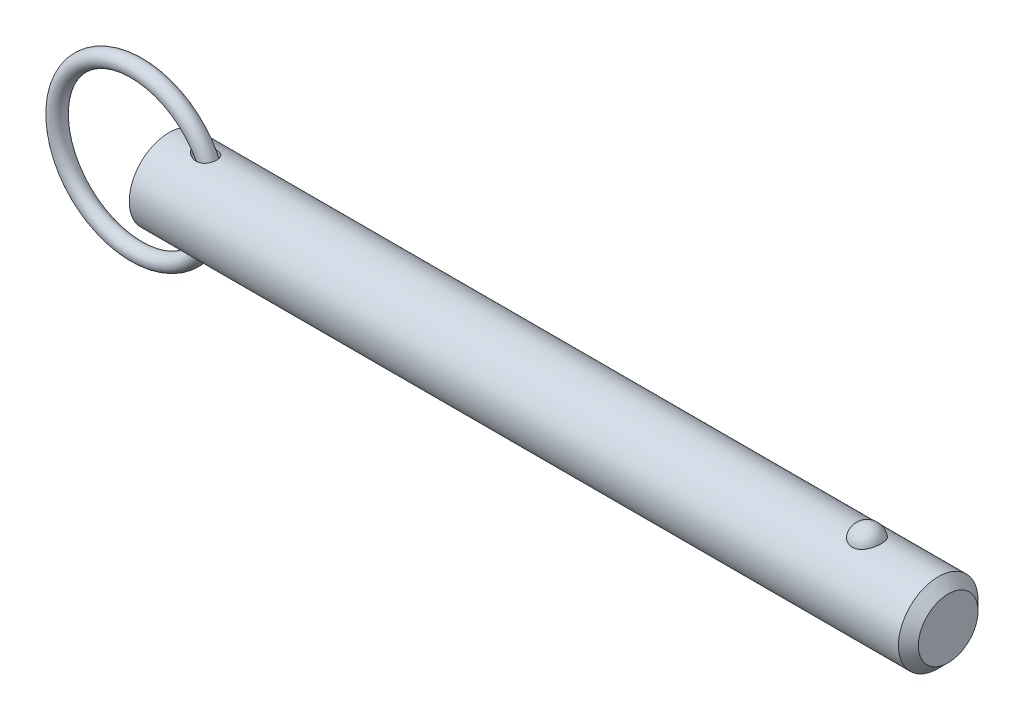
ISO-10303-21;
HEADER;
FILE_DESCRIPTION(('STEP AP214'),'2;1');
FILE_NAME('part.step','',(''),(''),'','','');
FILE_SCHEMA(('AUTOMOTIVE_DESIGN { 1 0 10303 214 1 1 1 1 }'));
ENDSEC;
DATA;
#1=APPLICATION_CONTEXT('core data for automotive mechanical design processes');
#2=APPLICATION_PROTOCOL_DEFINITION('international standard','automotive_design',2000,#1);
#3=PRODUCT_CONTEXT('',#1,'mechanical');
#4=PRODUCT('Part','Part','',(#3));
#5=PRODUCT_RELATED_PRODUCT_CATEGORY('part','',(#4));
#6=PRODUCT_DEFINITION_FORMATION('','',#4);
#7=PRODUCT_DEFINITION_CONTEXT('part definition',#1,'design');
#8=PRODUCT_DEFINITION('design','',#6,#7);
#9=PRODUCT_DEFINITION_SHAPE('','',#8);
#10=(LENGTH_UNIT() NAMED_UNIT(*) SI_UNIT(.MILLI.,.METRE.));
#11=(NAMED_UNIT(*) PLANE_ANGLE_UNIT() SI_UNIT($,.RADIAN.));
#12=(NAMED_UNIT(*) SI_UNIT($,.STERADIAN.) SOLID_ANGLE_UNIT());
#13=UNCERTAINTY_MEASURE_WITH_UNIT(LENGTH_MEASURE(1.E-05),#10,'distance_accuracy_value','');
#14=(GEOMETRIC_REPRESENTATION_CONTEXT(3) GLOBAL_UNCERTAINTY_ASSIGNED_CONTEXT((#13)) GLOBAL_UNIT_ASSIGNED_CONTEXT((#10,
#11,#12)) REPRESENTATION_CONTEXT('',''));
#15=CARTESIAN_POINT('',(0.,0.,0.));
#16=DIRECTION('',(0.,0.,1.));
#17=DIRECTION('',(1.,0.,0.));
#18=AXIS2_PLACEMENT_3D('',#15,#16,#17);
#19=CARTESIAN_POINT('',(-6.46799987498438,0.,0.));
#20=DIRECTION('',(0.,0.,1.));
#21=DIRECTION('',(1.,0.,0.));
#22=AXIS2_PLACEMENT_3D('',#19,#20,#21);
#23=TOROIDAL_SURFACE('',#22,15.875,1.588);
#24=CARTESIAN_POINT('',(10.9950001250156,0.,0.));
#25=VERTEX_POINT('',#24);
#26=VERTEX_LOOP('',#25);
#27=FACE_BOUND('',#26,.T.);
#28=ADVANCED_FACE('P0_F12',(#27),#23,.T.);
#29=CLOSED_SHELL('',(#28));
#30=MANIFOLD_SOLID_BREP('P0_B1',#29);
#31=CARTESIAN_POINT('',(0.,0.,0.));
#32=DIRECTION('',(1.,0.,0.));
#33=DIRECTION('',(0.,0.,-1.));
#34=AXIS2_PLACEMENT_3D('',#31,#32,#33);
#35=CYLINDRICAL_SURFACE('',#34,7.94);
#36=CARTESIAN_POINT('',(5.37881269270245,7.8641200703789,-1.0950869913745));
#37=CARTESIAN_POINT('',(5.49078530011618,7.84653010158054,-1.22142628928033));
#38=CARTESIAN_POINT('',(5.61742164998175,7.82766483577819,-1.33478448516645));
#39=CARTESIAN_POINT('',(5.82155225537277,7.80005811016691,-1.48501770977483));
#40=CARTESIAN_POINT('',(5.89211597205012,7.79095331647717,-1.53186949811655));
#41=CARTESIAN_POINT('',(6.03726296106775,7.77331484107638,-1.61899652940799));
#42=CARTESIAN_POINT('',(6.11184478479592,7.76478095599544,-1.65927412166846));
#43=CARTESIAN_POINT('',(6.31831542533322,7.74290334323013,-1.75933205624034));
#44=CARTESIAN_POINT('',(6.45343253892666,7.73042593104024,-1.81276183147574));
#45=CARTESIAN_POINT('',(6.73017339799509,7.70966096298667,-1.89912673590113));
#46=CARTESIAN_POINT('',(6.87179099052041,7.70136953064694,-1.93208083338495));
#47=CARTESIAN_POINT('',(7.17522096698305,7.6896684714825,-1.97820987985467));
#48=CARTESIAN_POINT('',(7.33750100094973,7.68691980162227,-1.98871513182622));
#49=CARTESIAN_POINT('',(7.57994245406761,7.68880305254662,-1.98137951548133));
#50=CARTESIAN_POINT('',(7.66059155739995,7.69043175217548,-1.97508575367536));
#51=CARTESIAN_POINT('',(7.82077465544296,7.69570110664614,-1.95445819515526));
#52=CARTESIAN_POINT('',(7.9003091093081,7.69934090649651,-1.94012781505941));
#53=CARTESIAN_POINT('',(8.09280087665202,7.71066069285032,-1.89475688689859));
#54=CARTESIAN_POINT('',(8.20465204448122,7.71942251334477,-1.85909462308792));
#55=CARTESIAN_POINT('',(8.42059371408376,7.74035594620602,-1.7699066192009));
#56=CARTESIAN_POINT('',(8.52468939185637,7.75252525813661,-1.7163929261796));
#57=CARTESIAN_POINT('',(8.72211003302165,7.77903750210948,-1.59192358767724));
#58=CARTESIAN_POINT('',(8.81539818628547,7.79338749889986,-1.52091076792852));
#59=CARTESIAN_POINT('',(8.98759177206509,7.8225086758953,-1.36321590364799));
#60=CARTESIAN_POINT('',(9.06649712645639,7.83727985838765,-1.27653377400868));
#61=CARTESIAN_POINT('',(9.20311499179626,7.86453692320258,-1.09567667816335));
#62=CARTESIAN_POINT('',(9.26180839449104,7.8771064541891,-1.00225329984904));
#63=CARTESIAN_POINT('',(9.36257622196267,7.89954213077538,-0.8065472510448));
#64=CARTESIAN_POINT('',(9.40465301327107,7.9094086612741,-0.704265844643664));
#65=CARTESIAN_POINT('',(9.47062404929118,7.92520709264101,-0.495461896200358));
#66=CARTESIAN_POINT('',(9.49478817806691,7.9311972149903,-0.389028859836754));
#67=CARTESIAN_POINT('',(9.52544004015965,7.93883641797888,-0.173494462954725));
#68=CARTESIAN_POINT('',(9.5319278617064,7.94048552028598,-0.0643931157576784));
#69=CARTESIAN_POINT('',(9.52707996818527,7.93926454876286,0.153487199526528));
#70=CARTESIAN_POINT('',(9.51572796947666,7.93639034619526,0.26226578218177));
#71=CARTESIAN_POINT('',(9.47542322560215,7.92642470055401,0.476313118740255));
#72=CARTESIAN_POINT('',(9.44647056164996,7.91933327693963,0.581581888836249));
#73=CARTESIAN_POINT('',(9.3716401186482,7.90170355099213,0.785602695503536));
#74=CARTESIAN_POINT('',(9.32576415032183,7.89116561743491,0.884355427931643));
#75=CARTESIAN_POINT('',(9.21823065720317,7.8677977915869,1.07254831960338));
#76=CARTESIAN_POINT('',(9.15657431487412,7.85496807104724,1.16198917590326));
#77=CARTESIAN_POINT('',(9.01919194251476,7.82843688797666,1.32903649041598));
#78=CARTESIAN_POINT('',(8.94347744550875,7.81473614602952,1.40665255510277));
#79=CARTESIAN_POINT('',(8.78012086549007,7.7879321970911,1.5481977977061));
#80=CARTESIAN_POINT('',(8.69247914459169,7.77482897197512,1.61212739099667));
#81=CARTESIAN_POINT('',(8.50642314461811,7.75037063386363,1.72592270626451));
#82=CARTESIAN_POINT('',(8.40786430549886,7.73904540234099,1.77555777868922));
#83=CARTESIAN_POINT('',(8.2039870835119,7.71943979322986,1.85894844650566));
#84=CARTESIAN_POINT('',(8.0986670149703,7.7111601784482,1.89270006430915));
#85=CARTESIAN_POINT('',(7.87703213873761,7.69782475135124,1.94625652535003));
#86=CARTESIAN_POINT('',(7.76044899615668,7.69301557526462,1.96500324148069));
#87=CARTESIAN_POINT('',(7.52574256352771,7.68770484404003,1.98567257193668));
#88=CARTESIAN_POINT('',(7.40761868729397,7.68720497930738,1.98758858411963));
#89=CARTESIAN_POINT('',(7.15639592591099,7.69044495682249,1.97502233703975));
#90=CARTESIAN_POINT('',(7.02341871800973,7.69476380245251,1.9583009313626));
#91=CARTESIAN_POINT('',(6.7612589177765,7.70776394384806,1.90648094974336));
#92=CARTESIAN_POINT('',(6.6320804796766,7.71644984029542,1.87136299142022));
#93=CARTESIAN_POINT('',(6.35978215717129,7.73875442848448,1.77707737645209));
#94=CARTESIAN_POINT('',(6.2177212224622,7.75293863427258,1.71496895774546));
#95=CARTESIAN_POINT('',(5.94559201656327,7.78383102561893,1.56880760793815));
#96=CARTESIAN_POINT('',(5.81552062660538,7.80053855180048,1.48476040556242));
#97=CARTESIAN_POINT('',(5.60081087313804,7.83035955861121,1.31701356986));
#98=CARTESIAN_POINT('',(5.51265224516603,7.84340226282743,1.23780647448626));
#99=CARTESIAN_POINT('',(5.34976240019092,7.86852524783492,1.06647953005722));
#100=CARTESIAN_POINT('',(5.27500719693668,7.88060722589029,0.974383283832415));
#101=CARTESIAN_POINT('',(5.15877594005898,7.89990441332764,0.800548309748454));
#102=CARTESIAN_POINT('',(5.11360209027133,7.90759876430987,0.721348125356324));
#103=CARTESIAN_POINT('',(5.03655060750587,7.92090267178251,0.556518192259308));
#104=CARTESIAN_POINT('',(5.00466157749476,7.92651401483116,0.470894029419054));
#105=CARTESIAN_POINT('',(4.95653766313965,7.93503671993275,0.294356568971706));
#106=CARTESIAN_POINT('',(4.94043621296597,7.93792505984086,0.203404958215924));
#107=CARTESIAN_POINT('',(4.92605720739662,7.94050250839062,0.0200631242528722));
#108=CARTESIAN_POINT('',(4.92776929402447,7.9401934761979,-0.072326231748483));
#109=CARTESIAN_POINT('',(4.94742735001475,7.93667454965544,-0.24325091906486));
#110=CARTESIAN_POINT('',(4.96327131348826,7.93384031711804,-0.32204819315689));
#111=CARTESIAN_POINT('',(5.00707570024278,7.92609115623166,-0.47605810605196));
#112=CARTESIAN_POINT('',(5.0350396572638,7.92117562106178,-0.551269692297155));
#113=CARTESIAN_POINT('',(5.10737112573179,7.90866290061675,-0.70999547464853));
#114=CARTESIAN_POINT('',(5.15379379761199,7.90074105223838,-0.792541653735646));
#115=CARTESIAN_POINT('',(5.2582083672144,7.88338732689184,-0.949781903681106));
#116=CARTESIAN_POINT('',(5.31621941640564,7.87395295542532,-1.02446265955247));
#117=CARTESIAN_POINT('',(5.37881269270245,7.8641200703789,-1.0950869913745));
#118=B_SPLINE_CURVE_WITH_KNOTS('',3,(#36,#37,#38,#39,#40,#41,#42,#43,#44,#45,#46,#47,#48,#49,
#50,#51,#52,#53,#54,#55,#56,#57,#58,#59,#60,#61,#62,#63,#64,#65,#66,#67,#68,#69,#70,#71,#72,#73,
#74,#75,#76,#77,#78,#79,#80,#81,#82,#83,#84,#85,#86,#87,#88,#89,#90,#91,#92,#93,#94,#95,#96,#97,
#98,#99,#100,#101,#102,#103,#104,#105,#106,#107,#108,#109,#110,#111,#112,#113,#114,#115,#116,
#117),.UNSPECIFIED.,.T.,.F.,(4,2,2,2,2,2,2,2,2,2,2,2,2,2,2,2,2,2,2,2,2,2,2,2,2,2,2,2,2,2,2,2,2,
2,2,2,2,2,2,2,4),(0.,0.508599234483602,0.763935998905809,1.01918131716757,1.45492798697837,
1.89027038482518,2.37502798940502,2.61739702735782,2.8596631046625,3.21120678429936,
3.56251370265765,3.91498401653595,4.26745624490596,4.59897839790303,4.93045331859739,
5.2568264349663,5.58319792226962,5.909867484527,6.23653553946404,6.56316865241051,
6.88977729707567,7.21611917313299,7.54245114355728,7.87378632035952,8.20520442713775,
8.55832700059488,8.91158808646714,9.31234018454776,9.71351536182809,10.1786231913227,
10.6436096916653,11.0001264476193,11.3559986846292,11.6294791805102,11.9027245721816,
12.1782599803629,12.4536351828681,12.693828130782,12.9340911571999,13.2179277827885,
13.5022374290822),.UNSPECIFIED.);
#119=CARTESIAN_POINT('',(5.37881269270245,7.8641200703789,-1.0950869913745));
#120=VERTEX_POINT('',#119);
#121=EDGE_CURVE('P1_E40',#120,#120,#118,.T.);
#122=ORIENTED_EDGE('',*,*,#121,.T.);
#123=EDGE_LOOP('',(#122));
#124=FACE_BOUND('',#123,.T.);
#125=CARTESIAN_POINT('',(153.595,0.,0.));
#126=DIRECTION('',(1.,0.,0.));
#127=DIRECTION('',(0.,0.,-1.));
#128=AXIS2_PLACEMENT_3D('',#125,#126,#127);
#129=CIRCLE('',#128,7.94);
#130=CARTESIAN_POINT('',(153.595,0.,-7.94));
#131=VERTEX_POINT('',#130);
#132=EDGE_CURVE('P1_E25',#131,#131,#129,.T.);
#133=ORIENTED_EDGE('',*,*,#132,.F.);
#134=EDGE_LOOP('',(#133));
#135=FACE_BOUND('',#134,.T.);
#136=CARTESIAN_POINT('',(0.,0.,0.));
#137=DIRECTION('',(1.,0.,0.));
#138=DIRECTION('',(0.,0.,-1.));
#139=AXIS2_PLACEMENT_3D('',#136,#137,#138);
#140=CIRCLE('',#139,7.94);
#141=CARTESIAN_POINT('',(0.,0.,-7.94));
#142=VERTEX_POINT('',#141);
#143=EDGE_CURVE('P1_E9',#142,#142,#140,.T.);
#144=ORIENTED_EDGE('',*,*,#143,.T.);
#145=EDGE_LOOP('',(#144));
#146=FACE_BOUND('',#145,.T.);
#147=CARTESIAN_POINT('',(139.364907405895,7.37767842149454,2.93486986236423));
#148=CARTESIAN_POINT('',(139.212749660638,7.3776732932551,2.93487505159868));
#149=CARTESIAN_POINT('',(139.060632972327,7.38258419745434,2.92262454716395));
#150=CARTESIAN_POINT('',(138.760928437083,7.40163229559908,2.87404196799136));
#151=CARTESIAN_POINT('',(138.613339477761,7.41576720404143,2.83771585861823));
#152=CARTESIAN_POINT('',(138.327018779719,7.45161576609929,2.74218769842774));
#153=CARTESIAN_POINT('',(138.188274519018,7.47331841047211,2.68301886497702));
#154=CARTESIAN_POINT('',(137.922882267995,7.52194082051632,2.54350967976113));
#155=CARTESIAN_POINT('',(137.796236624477,7.54886159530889,2.46316523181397));
#156=CARTESIAN_POINT('',(137.554534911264,7.60594671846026,2.28090375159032));
#157=CARTESIAN_POINT('',(137.439906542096,7.63618114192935,2.1784421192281));
#158=CARTESIAN_POINT('',(137.228878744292,7.69614046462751,1.95608495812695));
#159=CARTESIAN_POINT('',(137.132482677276,7.72586526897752,1.83618622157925));
#160=CARTESIAN_POINT('',(136.955938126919,7.78314821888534,1.57628086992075));
#161=CARTESIAN_POINT('',(136.876707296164,7.81055035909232,1.43561546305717));
#162=CARTESIAN_POINT('',(136.741797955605,7.85879631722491,1.142363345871));
#163=CARTESIAN_POINT('',(136.686121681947,7.87963951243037,0.989775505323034));
#164=CARTESIAN_POINT('',(136.59881215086,7.91289645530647,0.674619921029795));
#165=CARTESIAN_POINT('',(136.56753090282,7.92518652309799,0.511941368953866));
#166=CARTESIAN_POINT('',(136.530975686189,7.93958930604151,0.183247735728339));
#167=CARTESIAN_POINT('',(136.525701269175,7.94170219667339,0.0172327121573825));
#168=CARTESIAN_POINT('',(136.541231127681,7.93554931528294,-0.31267286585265));
#169=CARTESIAN_POINT('',(136.561925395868,7.92732732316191,-0.476569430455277));
#170=CARTESIAN_POINT('',(136.62878655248,7.90141534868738,-0.79830524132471));
#171=CARTESIAN_POINT('',(136.674953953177,7.88372517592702,-0.956144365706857));
#172=CARTESIAN_POINT('',(136.791898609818,7.84066230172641,-1.26152073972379));
#173=CARTESIAN_POINT('',(136.862704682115,7.81528060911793,-1.40904568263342));
#174=CARTESIAN_POINT('',(137.027478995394,7.75948672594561,-1.68950598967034));
#175=CARTESIAN_POINT('',(137.121448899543,7.72907417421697,-1.82244030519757));
#176=CARTESIAN_POINT('',(137.330839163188,7.66640424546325,-2.07032792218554));
#177=CARTESIAN_POINT('',(137.446315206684,7.63414223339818,-2.18523308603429));
#178=CARTESIAN_POINT('',(137.6959006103,7.57149681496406,-2.39329737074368));
#179=CARTESIAN_POINT('',(137.830008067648,7.54111321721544,-2.48645870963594));
#180=CARTESIAN_POINT('',(138.110111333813,7.48650742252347,-2.64628132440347));
#181=CARTESIAN_POINT('',(138.255760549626,7.46215900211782,-2.71350554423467));
#182=CARTESIAN_POINT('',(138.557425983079,7.42171253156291,-2.82226614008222));
#183=CARTESIAN_POINT('',(138.713438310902,7.40561140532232,-2.86381209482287));
#184=CARTESIAN_POINT('',(139.022970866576,7.3842679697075,-2.9183907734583));
#185=CARTESIAN_POINT('',(139.176222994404,7.37852109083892,-2.93275024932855));
#186=CARTESIAN_POINT('',(139.483070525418,7.37700973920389,-2.93655208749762));
#187=CARTESIAN_POINT('',(139.636665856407,7.38124333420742,-2.92599927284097));
#188=CARTESIAN_POINT('',(139.934990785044,7.39890635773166,-2.88102897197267));
#189=CARTESIAN_POINT('',(140.079848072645,7.41205491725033,-2.84733999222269));
#190=CARTESIAN_POINT('',(140.36164329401,7.445801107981,-2.75788206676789));
#191=CARTESIAN_POINT('',(140.498580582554,7.46639934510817,-2.70211132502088));
#192=CARTESIAN_POINT('',(140.764061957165,7.51339098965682,-2.56858908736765));
#193=CARTESIAN_POINT('',(140.892354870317,7.53990200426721,-2.4903806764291));
#194=CARTESIAN_POINT('',(141.134244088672,7.59569503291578,-2.31462737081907));
#195=CARTESIAN_POINT('',(141.247837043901,7.6249776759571,-2.21707808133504));
#196=CARTESIAN_POINT('',(141.46322156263,7.68489473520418,-1.99982049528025));
#197=CARTESIAN_POINT('',(141.564148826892,7.71552419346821,-1.87925337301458));
#198=CARTESIAN_POINT('',(141.745186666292,7.77353016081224,-1.6226882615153));
#199=CARTESIAN_POINT('',(141.825293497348,7.80090608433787,-1.48668750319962));
#200=CARTESIAN_POINT('',(141.965361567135,7.85047992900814,-1.1981841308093));
#201=CARTESIAN_POINT('',(142.024587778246,7.87248183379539,-1.04529016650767));
#202=CARTESIAN_POINT('',(142.117982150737,7.90785114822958,-0.731080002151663));
#203=CARTESIAN_POINT('',(142.152149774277,7.92121837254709,-0.56976362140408));
#204=CARTESIAN_POINT('',(142.194795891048,7.93797834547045,-0.242812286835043));
#205=CARTESIAN_POINT('',(142.203204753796,7.94134405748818,-0.0771668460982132));
#206=CARTESIAN_POINT('',(142.193962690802,7.93767937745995,0.253276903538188));
#207=CARTESIAN_POINT('',(142.176312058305,7.93064910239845,0.418075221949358));
#208=CARTESIAN_POINT('',(142.115424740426,7.90695571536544,0.741525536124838));
#209=CARTESIAN_POINT('',(142.072281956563,7.8903279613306,0.900197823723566));
#210=CARTESIAN_POINT('',(141.96135358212,7.84916386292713,1.20759654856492));
#211=CARTESIAN_POINT('',(141.89356656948,7.82462706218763,1.35632241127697));
#212=CARTESIAN_POINT('',(141.734371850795,7.7700669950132,1.64032869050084));
#213=CARTESIAN_POINT('',(141.642861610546,7.7400200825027,1.7755471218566));
#214=CARTESIAN_POINT('',(141.438296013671,7.67774175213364,2.0280064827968));
#215=CARTESIAN_POINT('',(141.325241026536,7.64551037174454,2.14524772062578));
#216=CARTESIAN_POINT('',(141.080831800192,7.58265895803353,2.35778002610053));
#217=CARTESIAN_POINT('',(140.949583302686,7.5520309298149,2.45319004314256));
#218=CARTESIAN_POINT('',(140.671601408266,7.49579792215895,2.61999897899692));
#219=CARTESIAN_POINT('',(140.524867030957,7.47019326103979,2.69139637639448));
#220=CARTESIAN_POINT('',(140.212947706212,7.42622216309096,2.8105324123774));
#221=CARTESIAN_POINT('',(140.047220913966,7.40825002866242,2.85700910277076));
#222=CARTESIAN_POINT('',(139.709279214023,7.38398348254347,2.9191685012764));
#223=CARTESIAN_POINT('',(139.53706702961,7.3776842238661,2.93486399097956));
#224=CARTESIAN_POINT('',(139.364907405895,7.37767842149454,2.93486986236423));
#225=B_SPLINE_CURVE_WITH_KNOTS('',3,(#147,#148,#149,#150,#151,#152,#153,#154,#155,#156,#157,
#158,#159,#160,#161,#162,#163,#164,#165,#166,#167,#168,#169,#170,#171,#172,#173,#174,#175,#176,
#177,#178,#179,#180,#181,#182,#183,#184,#185,#186,#187,#188,#189,#190,#191,#192,#193,#194,#195,
#196,#197,#198,#199,#200,#201,#202,#203,#204,#205,#206,#207,#208,#209,#210,#211,#212,#213,#214,
#215,#216,#217,#218,#219,#220,#221,#222,#223,#224),.UNSPECIFIED.,.T.,.F.,(4,2,2,2,2,2,2,2,2,2,2,
2,2,2,2,2,2,2,2,2,2,2,2,2,2,2,2,2,2,2,2,2,2,2,2,2,2,2,4),(0.,0.455841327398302,
0.911569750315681,1.36663794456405,1.82179423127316,2.2897898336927,2.75787163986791,
3.24685368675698,3.73588214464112,4.23184282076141,4.72779494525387,5.22165321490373,
5.71552141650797,6.20996917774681,6.70445245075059,7.20023431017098,7.69596557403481,
8.18023418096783,8.66432203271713,9.1241069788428,9.58380291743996,10.0296503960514,
10.4755341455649,10.9312349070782,11.3870393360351,11.8654416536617,12.3439299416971,
12.8378875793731,13.3318558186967,13.8271581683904,14.3224549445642,14.8159385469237,
15.3094506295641,15.8051323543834,16.3008055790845,16.7937101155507,17.2866458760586,
17.8026240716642,18.3183879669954),.UNSPECIFIED.);
#226=CARTESIAN_POINT('',(139.364907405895,7.37767842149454,2.93486986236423));
#227=VERTEX_POINT('',#226);
#228=EDGE_CURVE('P1_E34',#227,#227,#225,.T.);
#229=ORIENTED_EDGE('',*,*,#228,.T.);
#230=EDGE_LOOP('',(#229));
#231=FACE_BOUND('',#230,.T.);
#232=CARTESIAN_POINT('',(5.37881269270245,-7.8641200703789,-1.0950869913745));
#233=CARTESIAN_POINT('',(5.31532711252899,-7.87409326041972,-1.02345575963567));
#234=CARTESIAN_POINT('',(5.25654962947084,-7.88365715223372,-0.947641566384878));
#235=CARTESIAN_POINT('',(5.15093536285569,-7.90122221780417,-0.787865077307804));
#236=CARTESIAN_POINT('',(5.10408931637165,-7.90922460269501,-0.703909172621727));
#237=CARTESIAN_POINT('',(5.02499142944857,-7.92292057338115,-0.527991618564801));
#238=CARTESIAN_POINT('',(4.99290048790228,-7.92858863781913,-0.435954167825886));
#239=CARTESIAN_POINT('',(4.94718343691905,-7.93670712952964,-0.247266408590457));
#240=CARTESIAN_POINT('',(4.93353142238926,-7.93916207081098,-0.150622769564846));
#241=CARTESIAN_POINT('',(4.92669426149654,-7.94038957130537,0.0306459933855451));
#242=CARTESIAN_POINT('',(4.93105622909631,-7.93960347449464,0.115182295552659));
#243=CARTESIAN_POINT('',(4.95441758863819,-7.93542535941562,0.282133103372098));
#244=CARTESIAN_POINT('',(4.97342060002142,-7.93203269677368,0.364547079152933));
#245=CARTESIAN_POINT('',(5.02337664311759,-7.92322764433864,0.521528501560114));
#246=CARTESIAN_POINT('',(5.05377582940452,-7.91790920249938,0.596281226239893));
#247=CARTESIAN_POINT('',(5.1246872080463,-7.90571364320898,0.740640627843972));
#248=CARTESIAN_POINT('',(5.16520358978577,-7.89883588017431,0.81024515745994));
#249=CARTESIAN_POINT('',(5.27792634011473,-7.88012470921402,0.978620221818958));
#250=CARTESIAN_POINT('',(5.35563200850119,-7.86757912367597,1.07363778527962));
#251=CARTESIAN_POINT('',(5.52523836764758,-7.84150676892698,1.24994147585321));
#252=CARTESIAN_POINT('',(5.61717506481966,-7.82797755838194,1.33119164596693));
#253=CARTESIAN_POINT('',(5.8391371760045,-7.79742756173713,1.50104748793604));
#254=CARTESIAN_POINT('',(5.9725742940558,-7.78050347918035,1.58521567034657));
#255=CARTESIAN_POINT('',(6.25160600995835,-7.74942135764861,1.73078109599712));
#256=CARTESIAN_POINT('',(6.39720857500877,-7.73526515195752,1.79216327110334));
#257=CARTESIAN_POINT('',(6.69793322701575,-7.7116170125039,1.89134478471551));
#258=CARTESIAN_POINT('',(6.85312134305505,-7.70216275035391,1.92895428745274));
#259=CARTESIAN_POINT('',(7.16781951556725,-7.68988337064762,1.97736316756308));
#260=CARTESIAN_POINT('',(7.32732244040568,-7.68704791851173,1.98820434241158));
#261=CARTESIAN_POINT('',(7.61290770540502,-7.68890797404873,1.98097687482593));
#262=CARTESIAN_POINT('',(7.73913797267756,-7.69217875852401,1.96837928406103));
#263=CARTESIAN_POINT('',(7.98774248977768,-7.70364253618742,1.92303262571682));
#264=CARTESIAN_POINT('',(8.11011880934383,-7.71183283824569,1.89029457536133));
#265=CARTESIAN_POINT('',(8.34766306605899,-7.73253074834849,1.80375920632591));
#266=CARTESIAN_POINT('',(8.46278682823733,-7.74506226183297,1.74984505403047));
#267=CARTESIAN_POINT('',(8.6806268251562,-7.77294147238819,1.62149891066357));
#268=CARTESIAN_POINT('',(8.78334736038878,-7.78828818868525,1.54707406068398));
#269=CARTESIAN_POINT('',(8.96275951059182,-7.81808719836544,1.38814746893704));
#270=CARTESIAN_POINT('',(9.0410292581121,-7.83247448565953,1.30540890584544));
#271=CARTESIAN_POINT('',(9.18176824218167,-7.86008608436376,1.12727331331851));
#272=CARTESIAN_POINT('',(9.24424163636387,-7.87331070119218,1.03187962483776));
#273=CARTESIAN_POINT('',(9.34924815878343,-7.89649032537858,0.835684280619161));
#274=CARTESIAN_POINT('',(9.39252490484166,-7.90656172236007,0.735293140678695));
#275=CARTESIAN_POINT('',(9.46188913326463,-7.92307290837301,0.528458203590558));
#276=CARTESIAN_POINT('',(9.48797767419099,-7.92951292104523,0.422014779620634));
#277=CARTESIAN_POINT('',(9.5222867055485,-7.93804067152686,0.20658939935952));
#278=CARTESIAN_POINT('',(9.53058328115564,-7.94014694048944,0.0976202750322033));
#279=CARTESIAN_POINT('',(9.52935292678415,-7.93983698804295,-0.120212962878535));
#280=CARTESIAN_POINT('',(9.51982577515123,-7.93742071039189,-0.229077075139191));
#281=CARTESIAN_POINT('',(9.48313466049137,-7.92831916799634,-0.44375138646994));
#282=CARTESIAN_POINT('',(9.45594838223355,-7.92162850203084,-0.549557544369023));
#283=CARTESIAN_POINT('',(9.3845465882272,-7.90469917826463,-0.754954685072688));
#284=CARTESIAN_POINT('',(9.34033171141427,-7.89446065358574,-0.854545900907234));
#285=CARTESIAN_POINT('',(9.23602927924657,-7.87157146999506,-1.04456732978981));
#286=CARTESIAN_POINT('',(9.17596171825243,-7.85892385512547,-1.13500888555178));
#287=CARTESIAN_POINT('',(9.04153430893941,-7.83259746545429,-1.30436780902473));
#288=CARTESIAN_POINT('',(8.96717562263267,-7.81891877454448,-1.38328611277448));
#289=CARTESIAN_POINT('',(8.80603455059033,-7.79196869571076,-1.52782923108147));
#290=CARTESIAN_POINT('',(8.71921490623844,-7.77869867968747,-1.59341269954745));
#291=CARTESIAN_POINT('',(8.53589430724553,-7.7539823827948,-1.7096493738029));
#292=CARTESIAN_POINT('',(8.439392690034,-7.74253622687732,-1.76030155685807));
#293=CARTESIAN_POINT('',(8.23614706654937,-7.72219212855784,-1.84754820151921));
#294=CARTESIAN_POINT('',(8.12916866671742,-7.71339202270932,-1.88361685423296));
#295=CARTESIAN_POINT('',(7.91082287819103,-7.69955300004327,-1.93940887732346));
#296=CARTESIAN_POINT('',(7.79945379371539,-7.69451555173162,-1.95912586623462));
#297=CARTESIAN_POINT('',(7.56409927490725,-7.6881073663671,-1.98413612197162));
#298=CARTESIAN_POINT('',(7.43993744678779,-7.68713944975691,-1.98784574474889));
#299=CARTESIAN_POINT('',(7.19239878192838,-7.68969629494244,-1.97792309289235));
#300=CARTESIAN_POINT('',(7.06902225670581,-7.69322274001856,-1.96428432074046));
#301=CARTESIAN_POINT('',(6.80624991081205,-7.70498367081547,-1.91768089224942));
#302=CARTESIAN_POINT('',(6.66736121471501,-7.71386737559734,-1.88203087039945));
#303=CARTESIAN_POINT('',(6.39625444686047,-7.73551250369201,-1.79098714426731));
#304=CARTESIAN_POINT('',(6.26404857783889,-7.74828074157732,-1.73555871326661));
#305=CARTESIAN_POINT('',(6.06559048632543,-7.77003865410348,-1.63446133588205));
#306=CARTESIAN_POINT('',(5.99591479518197,-7.77821880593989,-1.59522999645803));
#307=CARTESIAN_POINT('',(5.86025875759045,-7.79503524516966,-1.51091846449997));
#308=CARTESIAN_POINT('',(5.79427944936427,-7.8036716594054,-1.46583664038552));
#309=CARTESIAN_POINT('',(5.60322733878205,-7.82978128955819,-1.3219827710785));
#310=CARTESIAN_POINT('',(5.48449649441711,-7.84751780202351,-1.21433077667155));
#311=CARTESIAN_POINT('',(5.37881269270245,-7.8641200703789,-1.0950869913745));
#312=B_SPLINE_CURVE_WITH_KNOTS('',3,(#232,#233,#234,#235,#236,#237,#238,#239,#240,#241,#242,
#243,#244,#245,#246,#247,#248,#249,#250,#251,#252,#253,#254,#255,#256,#257,#258,#259,#260,#261,
#262,#263,#264,#265,#266,#267,#268,#269,#270,#271,#272,#273,#274,#275,#276,#277,#278,#279,#280,
#281,#282,#283,#284,#285,#286,#287,#288,#289,#290,#291,#292,#293,#294,#295,#296,#297,#298,#299,
#300,#301,#302,#303,#304,#305,#306,#307,#308,#309,#310,#311),.UNSPECIFIED.,.T.,.F.,(4,2,2,2,2,2,
2,2,2,2,2,2,2,2,2,2,2,2,2,2,2,2,2,2,2,2,2,2,2,2,2,2,2,2,2,2,2,2,2,4),(0.,0.288363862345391,
0.576503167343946,0.867714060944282,1.15851540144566,1.41111828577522,1.66378363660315,
1.90549406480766,2.1473047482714,2.51540453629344,2.88445136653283,3.35805159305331,
3.83196445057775,4.30961543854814,4.78652012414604,5.16565662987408,5.54458592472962,
5.92563591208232,6.30655339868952,6.64920782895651,6.99177197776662,7.31956587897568,
7.64733959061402,7.97370879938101,8.30008206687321,8.62686856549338,8.95364280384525,
9.28000684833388,9.60634436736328,9.93367879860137,10.261035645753,10.59932199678,
10.9377403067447,11.308967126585,11.6803330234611,12.1096921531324,12.5398088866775,
12.7806650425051,13.0215885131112,13.5016249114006),.UNSPECIFIED.);
#313=CARTESIAN_POINT('',(5.37881269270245,-7.8641200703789,-1.0950869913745));
#314=VERTEX_POINT('',#313);
#315=EDGE_CURVE('P1_E17',#314,#314,#312,.T.);
#316=ORIENTED_EDGE('',*,*,#315,.T.);
#317=EDGE_LOOP('',(#316));
#318=FACE_BOUND('',#317,.T.);
#319=ADVANCED_FACE('P1_F13',(#124,#135,#146,#231,#318),#35,.T.);
#320=CARTESIAN_POINT('',(0.,0.,0.));
#321=DIRECTION('',(-1.,0.,0.));
#322=DIRECTION('',(0.,0.,1.));
#323=AXIS2_PLACEMENT_3D('',#320,#321,#322);
#324=PLANE('',#323);
#325=ORIENTED_EDGE('',*,*,#143,.F.);
#326=EDGE_LOOP('',(#325));
#327=FACE_BOUND('',#326,.T.);
#328=ADVANCED_FACE('P1_F15',(#327),#324,.T.);
#329=CARTESIAN_POINT('',(155.58,0.,0.));
#330=DIRECTION('',(-1.,0.,0.));
#331=DIRECTION('',(0.,0.,1.));
#332=AXIS2_PLACEMENT_3D('',#329,#330,#331);
#333=CONICAL_SURFACE('',#332,5.95500000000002,0.785398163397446);
#334=ORIENTED_EDGE('',*,*,#132,.T.);
#335=EDGE_LOOP('',(#334));
#336=FACE_BOUND('',#335,.T.);
#337=CARTESIAN_POINT('',(155.58,0.,0.));
#338=DIRECTION('',(1.,0.,0.));
#339=DIRECTION('',(0.,0.,-1.));
#340=AXIS2_PLACEMENT_3D('',#337,#338,#339);
#341=CIRCLE('',#340,5.95500000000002);
#342=CARTESIAN_POINT('',(155.58,0.,-5.95500000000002));
#343=VERTEX_POINT('',#342);
#344=EDGE_CURVE('P1_E30',#343,#343,#341,.T.);
#345=ORIENTED_EDGE('',*,*,#344,.F.);
#346=EDGE_LOOP('',(#345));
#347=FACE_BOUND('',#346,.T.);
#348=ADVANCED_FACE('P1_F55',(#336,#347),#333,.T.);
#349=CARTESIAN_POINT('',(155.58,5.95500000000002,0.));
#350=DIRECTION('',(1.,0.,0.));
#351=DIRECTION('',(0.,0.,-1.));
#352=AXIS2_PLACEMENT_3D('',#349,#350,#351);
#353=PLANE('',#352);
#354=ORIENTED_EDGE('',*,*,#344,.T.);
#355=EDGE_LOOP('',(#354));
#356=FACE_BOUND('',#355,.T.);
#357=ADVANCED_FACE('P1_F51',(#356),#353,.T.);
#358=CARTESIAN_POINT('',(139.364907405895,7.14599999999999,0.));
#359=DIRECTION('',(-1.,0.,0.));
#360=DIRECTION('',(0.,1.,0.));
#361=AXIS2_PLACEMENT_3D('',#358,#359,#360);
#362=SPHERICAL_SURFACE('',#361,2.944);
#363=ORIENTED_EDGE('',*,*,#228,.F.);
#364=EDGE_LOOP('',(#363));
#365=FACE_BOUND('',#364,.T.);
#366=ADVANCED_FACE('P1_F46',(#365),#362,.T.);
#367=CARTESIAN_POINT('',(-6.46799987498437,0.,0.));
#368=DIRECTION('',(0.,0.,1.));
#369=DIRECTION('',(1.,0.,0.));
#370=AXIS2_PLACEMENT_3D('',#367,#368,#369);
#371=TOROIDAL_SURFACE('',#370,15.875,1.985);
#372=ORIENTED_EDGE('',*,*,#315,.F.);
#373=EDGE_LOOP('',(#372));
#374=FACE_BOUND('',#373,.T.);
#375=ORIENTED_EDGE('',*,*,#121,.F.);
#376=EDGE_LOOP('',(#375));
#377=FACE_BOUND('',#376,.T.);
#378=ADVANCED_FACE('P1_F50',(#374,#377),#371,.F.);
#379=CLOSED_SHELL('',(#319,#328,#348,#357,#366,#378));
#380=MANIFOLD_SOLID_BREP('P1_B1',#379);
#381=ADVANCED_BREP_SHAPE_REPRESENTATION('',(#18,#30,#380),#14);
#382=SHAPE_DEFINITION_REPRESENTATION(#9,#381);
ENDSEC;
END-ISO-10303-21;
